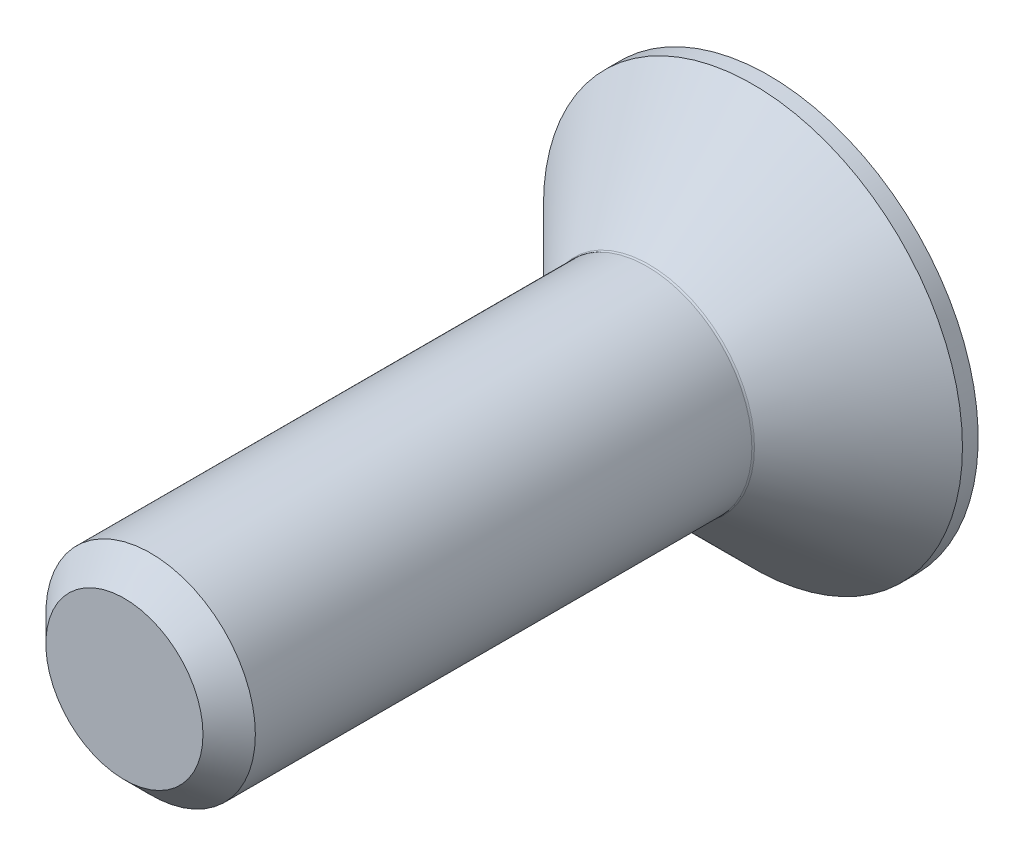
ISO-10303-21;
HEADER;
FILE_DESCRIPTION(('STEP AP214'),'2;1');
FILE_NAME('part.step','',(''),(''),'','','');
FILE_SCHEMA(('AUTOMOTIVE_DESIGN { 1 0 10303 214 1 1 1 1 }'));
ENDSEC;
DATA;
#1=APPLICATION_CONTEXT('core data for automotive mechanical design processes');
#2=APPLICATION_PROTOCOL_DEFINITION('international standard','automotive_design',2000,#1);
#3=PRODUCT_CONTEXT('',#1,'mechanical');
#4=PRODUCT('Part','Part','',(#3));
#5=PRODUCT_RELATED_PRODUCT_CATEGORY('part','',(#4));
#6=PRODUCT_DEFINITION_FORMATION('','',#4);
#7=PRODUCT_DEFINITION_CONTEXT('part definition',#1,'design');
#8=PRODUCT_DEFINITION('design','',#6,#7);
#9=PRODUCT_DEFINITION_SHAPE('','',#8);
#10=(LENGTH_UNIT() NAMED_UNIT(*) SI_UNIT(.MILLI.,.METRE.));
#11=(NAMED_UNIT(*) PLANE_ANGLE_UNIT() SI_UNIT($,.RADIAN.));
#12=(NAMED_UNIT(*) SI_UNIT($,.STERADIAN.) SOLID_ANGLE_UNIT());
#13=UNCERTAINTY_MEASURE_WITH_UNIT(LENGTH_MEASURE(1.E-05),#10,'distance_accuracy_value','');
#14=(GEOMETRIC_REPRESENTATION_CONTEXT(3) GLOBAL_UNCERTAINTY_ASSIGNED_CONTEXT((#13)) GLOBAL_UNIT_ASSIGNED_CONTEXT((#10,
#11,#12)) REPRESENTATION_CONTEXT('',''));
#15=CARTESIAN_POINT('',(0.,0.,0.));
#16=DIRECTION('',(0.,0.,1.));
#17=DIRECTION('',(1.,0.,0.));
#18=AXIS2_PLACEMENT_3D('',#15,#16,#17);
#19=CARTESIAN_POINT('',(-165.,-88.,-168.));
#20=DIRECTION('',(0.,0.,1.));
#21=DIRECTION('',(1.,0.,0.));
#22=AXIS2_PLACEMENT_3D('',#19,#20,#21);
#23=CYLINDRICAL_SURFACE('',#22,4.);
#24=CARTESIAN_POINT('',(-165.,-88.,-168.));
#25=DIRECTION('',(0.,0.,-1.));
#26=DIRECTION('',(-1.,0.,0.));
#27=AXIS2_PLACEMENT_3D('',#24,#25,#26);
#28=CIRCLE('',#27,4.);
#29=CARTESIAN_POINT('',(-169.,-88.,-168.));
#30=VERTEX_POINT('',#29);
#31=EDGE_CURVE('E150',#30,#30,#28,.T.);
#32=ORIENTED_EDGE('',*,*,#31,.F.);
#33=EDGE_LOOP('',(#32));
#34=FACE_BOUND('',#33,.T.);
#35=CARTESIAN_POINT('',(-165.,-88.,-167.7));
#36=DIRECTION('',(0.,0.,-1.));
#37=DIRECTION('',(-1.,0.,0.));
#38=AXIS2_PLACEMENT_3D('',#35,#36,#37);
#39=CIRCLE('',#38,4.);
#40=CARTESIAN_POINT('',(-169.,-88.,-167.7));
#41=VERTEX_POINT('',#40);
#42=EDGE_CURVE('E141',#41,#41,#39,.T.);
#43=ORIENTED_EDGE('',*,*,#42,.T.);
#44=EDGE_LOOP('',(#43));
#45=FACE_BOUND('',#44,.T.);
#46=ADVANCED_FACE('F16',(#34,#45),#23,.T.);
#47=CARTESIAN_POINT('',(-165.,-88.,-168.));
#48=DIRECTION('',(0.,0.,-1.));
#49=DIRECTION('',(-1.,0.,0.));
#50=AXIS2_PLACEMENT_3D('',#47,#48,#49);
#51=PLANE('',#50);
#52=DIRECTION('',(-0.500000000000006,0.866025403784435,0.));
#53=VECTOR('',#52,1.);
#54=CARTESIAN_POINT('',(-165.721687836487,-89.25,-168.));
#55=LINE('',#54,#53);
#56=CARTESIAN_POINT('',(-165.721687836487,-89.25,-168.));
#57=VERTEX_POINT('',#56);
#58=CARTESIAN_POINT('',(-166.443375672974,-88.,-168.));
#59=VERTEX_POINT('',#58);
#60=EDGE_CURVE('E93',#57,#59,#55,.T.);
#61=ORIENTED_EDGE('',*,*,#60,.F.);
#62=DIRECTION('',(-1.,0.,0.));
#63=VECTOR('',#62,1.);
#64=CARTESIAN_POINT('',(-164.278312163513,-89.25,-168.));
#65=LINE('',#64,#63);
#66=CARTESIAN_POINT('',(-164.278312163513,-89.25,-168.));
#67=VERTEX_POINT('',#66);
#68=EDGE_CURVE('E100',#67,#57,#65,.T.);
#69=ORIENTED_EDGE('',*,*,#68,.F.);
#70=DIRECTION('',(-0.499999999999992,-0.866025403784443,0.));
#71=VECTOR('',#70,1.);
#72=CARTESIAN_POINT('',(-163.556624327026,-88.,-168.));
#73=LINE('',#72,#71);
#74=CARTESIAN_POINT('',(-163.556624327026,-88.,-168.));
#75=VERTEX_POINT('',#74);
#76=EDGE_CURVE('E107',#75,#67,#73,.T.);
#77=ORIENTED_EDGE('',*,*,#76,.F.);
#78=DIRECTION('',(0.499999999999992,-0.866025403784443,0.));
#79=VECTOR('',#78,1.);
#80=CARTESIAN_POINT('',(-164.278312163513,-86.75,-168.));
#81=LINE('',#80,#79);
#82=CARTESIAN_POINT('',(-164.278312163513,-86.75,-168.));
#83=VERTEX_POINT('',#82);
#84=EDGE_CURVE('E122',#83,#75,#81,.T.);
#85=ORIENTED_EDGE('',*,*,#84,.F.);
#86=DIRECTION('',(1.,0.,0.));
#87=VECTOR('',#86,1.);
#88=CARTESIAN_POINT('',(-165.721687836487,-86.75,-168.));
#89=LINE('',#88,#87);
#90=CARTESIAN_POINT('',(-165.721687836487,-86.75,-168.));
#91=VERTEX_POINT('',#90);
#92=EDGE_CURVE('E115',#91,#83,#89,.T.);
#93=ORIENTED_EDGE('',*,*,#92,.F.);
#94=DIRECTION('',(0.500000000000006,0.866025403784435,0.));
#95=VECTOR('',#94,1.);
#96=CARTESIAN_POINT('',(-166.443375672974,-88.,-168.));
#97=LINE('',#96,#95);
#98=EDGE_CURVE('E113',#59,#91,#97,.T.);
#99=ORIENTED_EDGE('',*,*,#98,.F.);
#100=EDGE_LOOP('',(#61,#69,#77,#85,#93,#99));
#101=FACE_BOUND('',#100,.T.);
#102=ORIENTED_EDGE('',*,*,#31,.T.);
#103=EDGE_LOOP('',(#102));
#104=FACE_BOUND('',#103,.T.);
#105=ADVANCED_FACE('F109',(#101,#104),#51,.T.);
#106=CARTESIAN_POINT('',(-165.,-88.,-165.7));
#107=DIRECTION('',(0.,0.,-1.));
#108=DIRECTION('',(1.,0.,0.));
#109=AXIS2_PLACEMENT_3D('',#106,#107,#108);
#110=CONICAL_SURFACE('',#109,2.,0.785398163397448);
#111=CARTESIAN_POINT('',(-165.,-88.,-165.71464466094));
#112=DIRECTION('',(0.,0.,1.));
#113=DIRECTION('',(1.,0.,0.));
#114=AXIS2_PLACEMENT_3D('',#111,#112,#113);
#115=CIRCLE('',#114,2.01464466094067);
#116=CARTESIAN_POINT('',(-162.985355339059,-88.,-165.71464466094));
#117=VERTEX_POINT('',#116);
#118=EDGE_CURVE('E147',#117,#117,#115,.F.);
#119=ORIENTED_EDGE('',*,*,#118,.T.);
#120=EDGE_LOOP('',(#119));
#121=FACE_BOUND('',#120,.T.);
#122=ORIENTED_EDGE('',*,*,#42,.F.);
#123=EDGE_LOOP('',(#122));
#124=FACE_BOUND('',#123,.T.);
#125=ADVANCED_FACE('F234',(#121,#124),#110,.T.);
#126=CARTESIAN_POINT('',(-165.,-88.,-155.7));
#127=DIRECTION('',(0.,0.,1.));
#128=DIRECTION('',(1.,0.,0.));
#129=AXIS2_PLACEMENT_3D('',#126,#127,#128);
#130=PLANE('',#129);
#131=CARTESIAN_POINT('',(-165.,-88.,-155.7));
#132=DIRECTION('',(0.,0.,1.));
#133=DIRECTION('',(1.,0.,0.));
#134=AXIS2_PLACEMENT_3D('',#131,#132,#133);
#135=CIRCLE('',#134,1.5);
#136=CARTESIAN_POINT('',(-163.5,-88.,-155.7));
#137=VERTEX_POINT('',#136);
#138=EDGE_CURVE('E138',#137,#137,#135,.T.);
#139=ORIENTED_EDGE('',*,*,#138,.T.);
#140=EDGE_LOOP('',(#139));
#141=FACE_BOUND('',#140,.T.);
#142=ADVANCED_FACE('F311',(#141),#130,.T.);
#143=CARTESIAN_POINT('',(-165.,-88.,-155.7));
#144=DIRECTION('',(0.,0.,-1.));
#145=DIRECTION('',(-1.,0.,0.));
#146=AXIS2_PLACEMENT_3D('',#143,#144,#145);
#147=CYLINDRICAL_SURFACE('',#146,2.);
#148=CARTESIAN_POINT('',(-165.,-88.,-165.679289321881));
#149=DIRECTION('',(0.,0.,1.));
#150=DIRECTION('',(1.,0.,0.));
#151=AXIS2_PLACEMENT_3D('',#148,#149,#150);
#152=CIRCLE('',#151,2.);
#153=CARTESIAN_POINT('',(-163.,-88.,-165.679289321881));
#154=VERTEX_POINT('',#153);
#155=EDGE_CURVE('E144',#154,#154,#152,.T.);
#156=ORIENTED_EDGE('',*,*,#155,.T.);
#157=EDGE_LOOP('',(#156));
#158=FACE_BOUND('',#157,.T.);
#159=CARTESIAN_POINT('',(-165.,-88.,-156.2));
#160=DIRECTION('',(0.,0.,1.));
#161=DIRECTION('',(1.,0.,0.));
#162=AXIS2_PLACEMENT_3D('',#159,#160,#161);
#163=CIRCLE('',#162,2.);
#164=CARTESIAN_POINT('',(-163.,-88.,-156.2));
#165=VERTEX_POINT('',#164);
#166=EDGE_CURVE('E134',#165,#165,#163,.F.);
#167=ORIENTED_EDGE('',*,*,#166,.T.);
#168=EDGE_LOOP('',(#167));
#169=FACE_BOUND('',#168,.T.);
#170=ADVANCED_FACE('F303',(#158,#169),#147,.T.);
#171=CARTESIAN_POINT('',(-165.,-88.,-156.2));
#172=DIRECTION('',(0.,0.,-1.));
#173=DIRECTION('',(-1.,0.,0.));
#174=AXIS2_PLACEMENT_3D('',#171,#172,#173);
#175=CONICAL_SURFACE('',#174,2.,0.785398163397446);
#176=ORIENTED_EDGE('',*,*,#138,.F.);
#177=EDGE_LOOP('',(#176));
#178=FACE_BOUND('',#177,.T.);
#179=ORIENTED_EDGE('',*,*,#166,.F.);
#180=EDGE_LOOP('',(#179));
#181=FACE_BOUND('',#180,.T.);
#182=ADVANCED_FACE('F296',(#178,#181),#175,.T.);
#183=CARTESIAN_POINT('',(-165.,-88.,-165.679289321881));
#184=DIRECTION('',(0.,0.,1.));
#185=DIRECTION('',(1.,0.,0.));
#186=AXIS2_PLACEMENT_3D('',#183,#184,#185);
#187=TOROIDAL_SURFACE('',#186,2.05,0.05);
#188=ORIENTED_EDGE('',*,*,#118,.F.);
#189=EDGE_LOOP('',(#188));
#190=FACE_BOUND('',#189,.T.);
#191=ORIENTED_EDGE('',*,*,#155,.F.);
#192=EDGE_LOOP('',(#191));
#193=FACE_BOUND('',#192,.T.);
#194=ADVANCED_FACE('F289',(#190,#193),#187,.F.);
#195=CARTESIAN_POINT('',(-165.721687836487,-89.25,-166.));
#196=DIRECTION('',(-0.866025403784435,-0.500000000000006,0.));
#197=DIRECTION('',(0.500000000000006,-0.866025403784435,0.));
#198=AXIS2_PLACEMENT_3D('',#195,#196,#197);
#199=PLANE('',#198);
#200=DIRECTION('',(0.,0.,-1.));
#201=VECTOR('',#200,1.);
#202=CARTESIAN_POINT('',(-166.443375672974,-88.,-166.));
#203=LINE('',#202,#201);
#204=CARTESIAN_POINT('',(-166.443375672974,-88.,-166.7));
#205=VERTEX_POINT('',#204);
#206=EDGE_CURVE('E133',#205,#59,#203,.T.);
#207=ORIENTED_EDGE('',*,*,#206,.F.);
#208=DIRECTION('',(0.500000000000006,-0.866025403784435,0.));
#209=VECTOR('',#208,1.);
#210=CARTESIAN_POINT('',(-165.721687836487,-89.25,-166.7));
#211=LINE('',#210,#209);
#212=CARTESIAN_POINT('',(-165.721687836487,-89.25,-166.7));
#213=VERTEX_POINT('',#212);
#214=EDGE_CURVE('E96',#205,#213,#211,.T.);
#215=ORIENTED_EDGE('',*,*,#214,.T.);
#216=DIRECTION('',(0.,0.,-1.));
#217=VECTOR('',#216,1.);
#218=CARTESIAN_POINT('',(-165.721687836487,-89.25,-166.));
#219=LINE('',#218,#217);
#220=EDGE_CURVE('E88',#213,#57,#219,.T.);
#221=ORIENTED_EDGE('',*,*,#220,.T.);
#222=ORIENTED_EDGE('',*,*,#60,.T.);
#223=EDGE_LOOP('',(#207,#215,#221,#222));
#224=FACE_BOUND('',#223,.T.);
#225=ADVANCED_FACE('F91',(#224),#199,.F.);
#226=CARTESIAN_POINT('',(-166.443375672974,-88.,-166.));
#227=DIRECTION('',(-0.866025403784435,0.500000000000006,0.));
#228=DIRECTION('',(-0.500000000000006,-0.866025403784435,0.));
#229=AXIS2_PLACEMENT_3D('',#226,#227,#228);
#230=PLANE('',#229);
#231=DIRECTION('',(0.,0.,-1.));
#232=VECTOR('',#231,1.);
#233=CARTESIAN_POINT('',(-165.721687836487,-86.75,-166.));
#234=LINE('',#233,#232);
#235=CARTESIAN_POINT('',(-165.721687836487,-86.75,-166.7));
#236=VERTEX_POINT('',#235);
#237=EDGE_CURVE('E131',#236,#91,#234,.T.);
#238=ORIENTED_EDGE('',*,*,#237,.F.);
#239=DIRECTION('',(-0.500000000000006,-0.866025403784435,0.));
#240=VECTOR('',#239,1.);
#241=CARTESIAN_POINT('',(-166.443375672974,-88.,-166.7));
#242=LINE('',#241,#240);
#243=EDGE_CURVE('E166',#236,#205,#242,.T.);
#244=ORIENTED_EDGE('',*,*,#243,.T.);
#245=ORIENTED_EDGE('',*,*,#206,.T.);
#246=ORIENTED_EDGE('',*,*,#98,.T.);
#247=EDGE_LOOP('',(#238,#244,#245,#246));
#248=FACE_BOUND('',#247,.T.);
#249=ADVANCED_FACE('F207',(#248),#230,.F.);
#250=CARTESIAN_POINT('',(-165.721687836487,-86.75,-166.));
#251=DIRECTION('',(0.,1.,0.));
#252=DIRECTION('',(0.,0.,1.));
#253=AXIS2_PLACEMENT_3D('',#250,#251,#252);
#254=PLANE('',#253);
#255=DIRECTION('',(0.,0.,-1.));
#256=VECTOR('',#255,1.);
#257=CARTESIAN_POINT('',(-164.278312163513,-86.75,-166.));
#258=LINE('',#257,#256);
#259=CARTESIAN_POINT('',(-164.278312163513,-86.75,-166.7));
#260=VERTEX_POINT('',#259);
#261=EDGE_CURVE('E129',#260,#83,#258,.T.);
#262=ORIENTED_EDGE('',*,*,#261,.F.);
#263=DIRECTION('',(-1.,0.,0.));
#264=VECTOR('',#263,1.);
#265=CARTESIAN_POINT('',(-165.721687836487,-86.75,-166.7));
#266=LINE('',#265,#264);
#267=EDGE_CURVE('E11',#260,#236,#266,.T.);
#268=ORIENTED_EDGE('',*,*,#267,.T.);
#269=ORIENTED_EDGE('',*,*,#237,.T.);
#270=ORIENTED_EDGE('',*,*,#92,.T.);
#271=EDGE_LOOP('',(#262,#268,#269,#270));
#272=FACE_BOUND('',#271,.T.);
#273=ADVANCED_FACE('F204',(#272),#254,.F.);
#274=CARTESIAN_POINT('',(-164.278312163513,-86.75,-166.));
#275=DIRECTION('',(0.866025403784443,0.499999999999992,0.));
#276=DIRECTION('',(-0.499999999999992,0.866025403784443,0.));
#277=AXIS2_PLACEMENT_3D('',#274,#275,#276);
#278=PLANE('',#277);
#279=DIRECTION('',(0.,0.,-1.));
#280=VECTOR('',#279,1.);
#281=CARTESIAN_POINT('',(-163.556624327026,-88.,-166.));
#282=LINE('',#281,#280);
#283=CARTESIAN_POINT('',(-163.556624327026,-88.,-166.7));
#284=VERTEX_POINT('',#283);
#285=EDGE_CURVE('E127',#284,#75,#282,.T.);
#286=ORIENTED_EDGE('',*,*,#285,.F.);
#287=DIRECTION('',(-0.499999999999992,0.866025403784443,0.));
#288=VECTOR('',#287,1.);
#289=CARTESIAN_POINT('',(-164.278312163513,-86.75,-166.7));
#290=LINE('',#289,#288);
#291=EDGE_CURVE('E25',#284,#260,#290,.T.);
#292=ORIENTED_EDGE('',*,*,#291,.T.);
#293=ORIENTED_EDGE('',*,*,#261,.T.);
#294=ORIENTED_EDGE('',*,*,#84,.T.);
#295=EDGE_LOOP('',(#286,#292,#293,#294));
#296=FACE_BOUND('',#295,.T.);
#297=ADVANCED_FACE('F218',(#296),#278,.F.);
#298=CARTESIAN_POINT('',(-163.556624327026,-88.,-166.));
#299=DIRECTION('',(0.866025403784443,-0.499999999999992,0.));
#300=DIRECTION('',(0.499999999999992,0.866025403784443,0.));
#301=AXIS2_PLACEMENT_3D('',#298,#299,#300);
#302=PLANE('',#301);
#303=DIRECTION('',(0.,0.,-1.));
#304=VECTOR('',#303,1.);
#305=CARTESIAN_POINT('',(-164.278312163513,-89.25,-166.));
#306=LINE('',#305,#304);
#307=CARTESIAN_POINT('',(-164.278312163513,-89.25,-166.7));
#308=VERTEX_POINT('',#307);
#309=EDGE_CURVE('E99',#308,#67,#306,.T.);
#310=ORIENTED_EDGE('',*,*,#309,.F.);
#311=DIRECTION('',(0.499999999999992,0.866025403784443,0.));
#312=VECTOR('',#311,1.);
#313=CARTESIAN_POINT('',(-163.556624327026,-88.,-166.7));
#314=LINE('',#313,#312);
#315=EDGE_CURVE('E40',#308,#284,#314,.T.);
#316=ORIENTED_EDGE('',*,*,#315,.T.);
#317=ORIENTED_EDGE('',*,*,#285,.T.);
#318=ORIENTED_EDGE('',*,*,#76,.T.);
#319=EDGE_LOOP('',(#310,#316,#317,#318));
#320=FACE_BOUND('',#319,.T.);
#321=ADVANCED_FACE('F216',(#320),#302,.F.);
#322=CARTESIAN_POINT('',(-164.278312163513,-89.25,-166.));
#323=DIRECTION('',(0.,-1.,0.));
#324=DIRECTION('',(0.,0.,-1.));
#325=AXIS2_PLACEMENT_3D('',#322,#323,#324);
#326=PLANE('',#325);
#327=ORIENTED_EDGE('',*,*,#220,.F.);
#328=DIRECTION('',(1.,0.,0.));
#329=VECTOR('',#328,1.);
#330=CARTESIAN_POINT('',(-164.278312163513,-89.25,-166.7));
#331=LINE('',#330,#329);
#332=EDGE_CURVE('E170',#213,#308,#331,.T.);
#333=ORIENTED_EDGE('',*,*,#332,.T.);
#334=ORIENTED_EDGE('',*,*,#309,.T.);
#335=ORIENTED_EDGE('',*,*,#68,.T.);
#336=EDGE_LOOP('',(#327,#333,#334,#335));
#337=FACE_BOUND('',#336,.T.);
#338=ADVANCED_FACE('F103',(#337),#326,.F.);
#339=CARTESIAN_POINT('',(-166.443375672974,-88.,-166.));
#340=DIRECTION('',(0.,0.,-1.));
#341=DIRECTION('',(-1.,0.,0.));
#342=AXIS2_PLACEMENT_3D('',#339,#340,#341);
#343=PLANE('',#342);
#344=DIRECTION('',(-0.500000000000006,0.866025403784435,0.));
#345=VECTOR('',#344,1.);
#346=CARTESIAN_POINT('',(-165.393375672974,-87.3937822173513,-166.));
#347=LINE('',#346,#345);
#348=CARTESIAN_POINT('',(-165.021687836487,-88.0375644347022,-166.));
#349=VERTEX_POINT('',#348);
#350=CARTESIAN_POINT('',(-165.043375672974,-88.,-166.));
#351=VERTEX_POINT('',#350);
#352=EDGE_CURVE('E161',#349,#351,#347,.T.);
#353=ORIENTED_EDGE('',*,*,#352,.T.);
#354=DIRECTION('',(0.500000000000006,0.866025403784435,0.));
#355=VECTOR('',#354,1.);
#356=CARTESIAN_POINT('',(-165.393375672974,-88.6062177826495,-166.));
#357=LINE('',#356,#355);
#358=CARTESIAN_POINT('',(-165.021687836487,-87.9624355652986,-166.));
#359=VERTEX_POINT('',#358);
#360=EDGE_CURVE('E163',#351,#359,#357,.T.);
#361=ORIENTED_EDGE('',*,*,#360,.T.);
#362=DIRECTION('',(1.,0.,0.));
#363=VECTOR('',#362,1.);
#364=CARTESIAN_POINT('',(-166.443375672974,-87.9624355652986,-166.));
#365=LINE('',#364,#363);
#366=CARTESIAN_POINT('',(-164.978312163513,-87.9624355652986,-166.));
#367=VERTEX_POINT('',#366);
#368=EDGE_CURVE('E153',#359,#367,#365,.T.);
#369=ORIENTED_EDGE('',*,*,#368,.T.);
#370=DIRECTION('',(0.499999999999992,-0.866025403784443,0.));
#371=VECTOR('',#370,1.);
#372=CARTESIAN_POINT('',(-165.328312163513,-87.3562177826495,-166.));
#373=LINE('',#372,#371);
#374=CARTESIAN_POINT('',(-164.956624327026,-88.,-166.));
#375=VERTEX_POINT('',#374);
#376=EDGE_CURVE('E155',#367,#375,#373,.T.);
#377=ORIENTED_EDGE('',*,*,#376,.T.);
#378=DIRECTION('',(-0.499999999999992,-0.866025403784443,0.));
#379=VECTOR('',#378,1.);
#380=CARTESIAN_POINT('',(-165.328312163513,-88.6437822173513,-166.));
#381=LINE('',#380,#379);
#382=CARTESIAN_POINT('',(-164.978312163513,-88.0375644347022,-166.));
#383=VERTEX_POINT('',#382);
#384=EDGE_CURVE('E157',#375,#383,#381,.T.);
#385=ORIENTED_EDGE('',*,*,#384,.T.);
#386=DIRECTION('',(-1.,0.,0.));
#387=VECTOR('',#386,1.);
#388=CARTESIAN_POINT('',(-166.443375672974,-88.0375644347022,-166.));
#389=LINE('',#388,#387);
#390=EDGE_CURVE('E159',#383,#349,#389,.T.);
#391=ORIENTED_EDGE('',*,*,#390,.T.);
#392=EDGE_LOOP('',(#353,#361,#369,#377,#385,#391));
#393=FACE_BOUND('',#392,.T.);
#394=ADVANCED_FACE('F194',(#393),#343,.T.);
#395=CARTESIAN_POINT('',(-165.328312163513,-88.6437822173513,-166.));
#396=DIRECTION('',(0.433012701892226,-0.25,0.866025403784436));
#397=DIRECTION('',(0.894427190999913,0.,-0.447213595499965));
#398=AXIS2_PLACEMENT_3D('',#395,#396,#397);
#399=PLANE('',#398);
#400=DIRECTION('',(-0.894427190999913,0.,0.447213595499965));
#401=VECTOR('',#400,1.);
#402=CARTESIAN_POINT('',(-165.253974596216,-88.,-165.851324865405));
#403=LINE('',#402,#401);
#404=EDGE_CURVE('E118',#284,#375,#403,.T.);
#405=ORIENTED_EDGE('',*,*,#404,.F.);
#406=ORIENTED_EDGE('',*,*,#315,.F.);
#407=DIRECTION('',(-0.447213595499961,0.77459666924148,0.447213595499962));
#408=VECTOR('',#407,1.);
#409=CARTESIAN_POINT('',(-165.271324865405,-87.5300515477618,-165.706987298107));
#410=LINE('',#409,#408);
#411=EDGE_CURVE('E20',#383,#308,#410,.F.);
#412=ORIENTED_EDGE('',*,*,#411,.F.);
#413=ORIENTED_EDGE('',*,*,#384,.F.);
#414=EDGE_LOOP('',(#405,#406,#412,#413));
#415=FACE_BOUND('',#414,.T.);
#416=ADVANCED_FACE('F18',(#415),#399,.F.);
#417=CARTESIAN_POINT('',(-166.443375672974,-88.0375644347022,-166.));
#418=DIRECTION('',(0.,-0.5,0.866025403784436));
#419=DIRECTION('',(0.,-0.866025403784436,-0.5));
#420=AXIS2_PLACEMENT_3D('',#417,#418,#419);
#421=PLANE('',#420);
#422=ORIENTED_EDGE('',*,*,#411,.T.);
#423=ORIENTED_EDGE('',*,*,#332,.F.);
#424=DIRECTION('',(0.447213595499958,0.774596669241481,0.447213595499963));
#425=VECTOR('',#424,1.);
#426=CARTESIAN_POINT('',(-164.873012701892,-87.7800515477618,-165.851324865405));
#427=LINE('',#426,#425);
#428=EDGE_CURVE('E181',#349,#213,#427,.F.);
#429=ORIENTED_EDGE('',*,*,#428,.F.);
#430=ORIENTED_EDGE('',*,*,#390,.F.);
#431=EDGE_LOOP('',(#422,#423,#429,#430));
#432=FACE_BOUND('',#431,.T.);
#433=ADVANCED_FACE('F215',(#432),#421,.F.);
#434=CARTESIAN_POINT('',(-165.328312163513,-87.3562177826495,-166.));
#435=DIRECTION('',(0.433012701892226,0.25,0.866025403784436));
#436=DIRECTION('',(0.894427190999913,0.,-0.447213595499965));
#437=AXIS2_PLACEMENT_3D('',#434,#435,#436);
#438=PLANE('',#437);
#439=ORIENTED_EDGE('',*,*,#404,.T.);
#440=ORIENTED_EDGE('',*,*,#376,.F.);
#441=DIRECTION('',(-0.447213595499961,-0.77459666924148,0.447213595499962));
#442=VECTOR('',#441,1.);
#443=CARTESIAN_POINT('',(-164.838312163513,-87.719948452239,-166.14));
#444=LINE('',#443,#442);
#445=EDGE_CURVE('E178',#260,#367,#444,.T.);
#446=ORIENTED_EDGE('',*,*,#445,.F.);
#447=ORIENTED_EDGE('',*,*,#291,.F.);
#448=EDGE_LOOP('',(#439,#440,#446,#447));
#449=FACE_BOUND('',#448,.T.);
#450=ADVANCED_FACE('F187',(#449),#438,.F.);
#451=CARTESIAN_POINT('',(-165.393375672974,-87.3937822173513,-166.));
#452=DIRECTION('',(-0.43301270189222,-0.250000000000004,0.866025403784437));
#453=DIRECTION('',(0.894427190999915,0.,0.447213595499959));
#454=AXIS2_PLACEMENT_3D('',#451,#452,#453);
#455=PLANE('',#454);
#456=ORIENTED_EDGE('',*,*,#428,.T.);
#457=ORIENTED_EDGE('',*,*,#214,.F.);
#458=DIRECTION('',(0.894427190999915,0.,0.447213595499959));
#459=VECTOR('',#458,1.);
#460=CARTESIAN_POINT('',(-165.323375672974,-88.,-166.14));
#461=LINE('',#460,#459);
#462=EDGE_CURVE('E176',#351,#205,#461,.F.);
#463=ORIENTED_EDGE('',*,*,#462,.F.);
#464=ORIENTED_EDGE('',*,*,#352,.F.);
#465=EDGE_LOOP('',(#456,#457,#463,#464));
#466=FACE_BOUND('',#465,.T.);
#467=ADVANCED_FACE('F213',(#466),#455,.F.);
#468=CARTESIAN_POINT('',(-166.443375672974,-87.9624355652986,-166.));
#469=DIRECTION('',(0.,0.5,0.866025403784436));
#470=DIRECTION('',(0.,-0.866025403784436,0.5));
#471=AXIS2_PLACEMENT_3D('',#468,#469,#470);
#472=PLANE('',#471);
#473=ORIENTED_EDGE('',*,*,#445,.T.);
#474=ORIENTED_EDGE('',*,*,#368,.F.);
#475=DIRECTION('',(-0.447213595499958,0.774596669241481,-0.447213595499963));
#476=VECTOR('',#475,1.);
#477=CARTESIAN_POINT('',(-164.873012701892,-88.219948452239,-165.851324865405));
#478=LINE('',#477,#476);
#479=EDGE_CURVE('E174',#236,#359,#478,.F.);
#480=ORIENTED_EDGE('',*,*,#479,.F.);
#481=ORIENTED_EDGE('',*,*,#267,.F.);
#482=EDGE_LOOP('',(#473,#474,#480,#481));
#483=FACE_BOUND('',#482,.T.);
#484=ADVANCED_FACE('F200',(#483),#472,.F.);
#485=CARTESIAN_POINT('',(-165.393375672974,-88.6062177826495,-166.));
#486=DIRECTION('',(-0.43301270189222,0.250000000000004,0.866025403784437));
#487=DIRECTION('',(0.894427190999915,0.,0.447213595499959));
#488=AXIS2_PLACEMENT_3D('',#485,#486,#487);
#489=PLANE('',#488);
#490=ORIENTED_EDGE('',*,*,#462,.T.);
#491=ORIENTED_EDGE('',*,*,#243,.F.);
#492=ORIENTED_EDGE('',*,*,#479,.T.);
#493=ORIENTED_EDGE('',*,*,#360,.F.);
#494=EDGE_LOOP('',(#490,#491,#492,#493));
#495=FACE_BOUND('',#494,.T.);
#496=ADVANCED_FACE('F209',(#495),#489,.F.);
#497=CLOSED_SHELL('',(#46,#105,#125,#142,#170,#182,#194,#225,#249,#273,#297,#321,#338,#394,#416,
#433,#450,#467,#484,#496));
#498=MANIFOLD_SOLID_BREP('B1',#497);
#499=ADVANCED_BREP_SHAPE_REPRESENTATION('',(#18,#498),#14);
#500=SHAPE_DEFINITION_REPRESENTATION(#9,#499);
ENDSEC;
END-ISO-10303-21;
